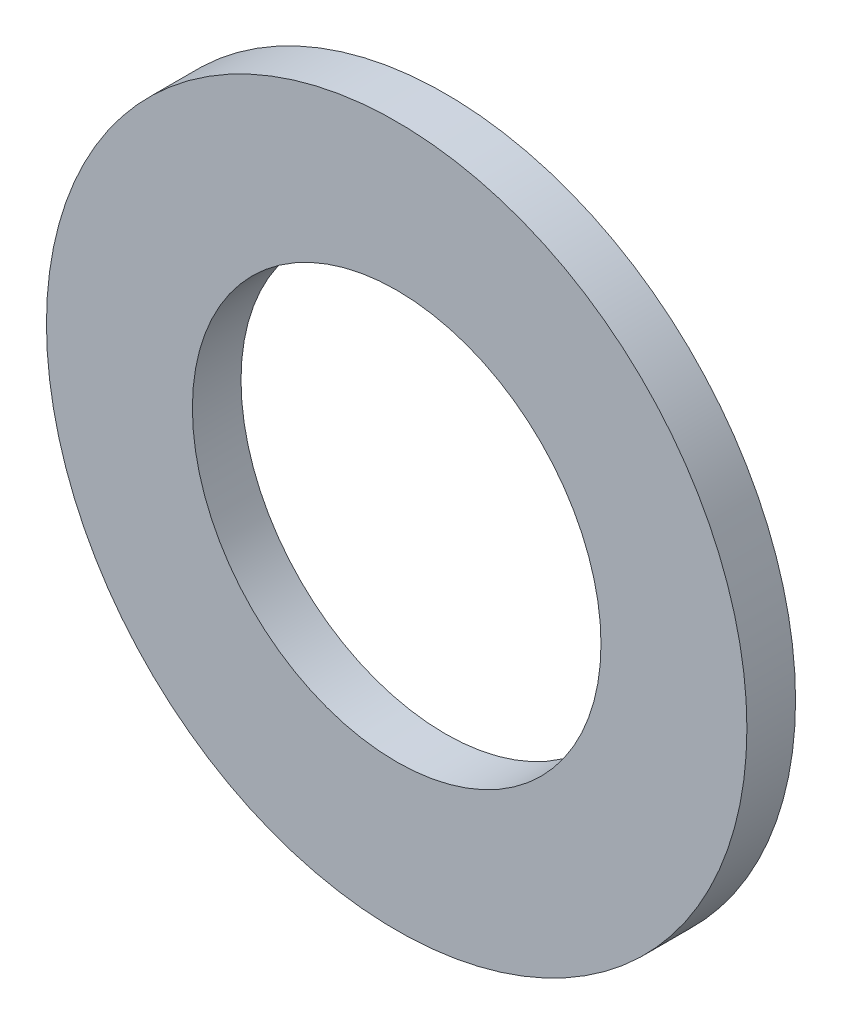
from build123d import *

# Parameters (mm, degrees)
ESQUISSE1_R      = 18
ESQUISSE1_R_2    = 10.5
EXTRUSION1_DEPTH = 2.5


with BuildPart() as part:
    # Esquisse1 → Extrusion1 (new body)
    with BuildSketch(Plane.XY):
        Circle(ESQUISSE1_R)
        Circle(ESQUISSE1_R_2, mode=Mode.SUBTRACT)
    extrude(amount=EXTRUSION1_DEPTH)


solid = part.part
